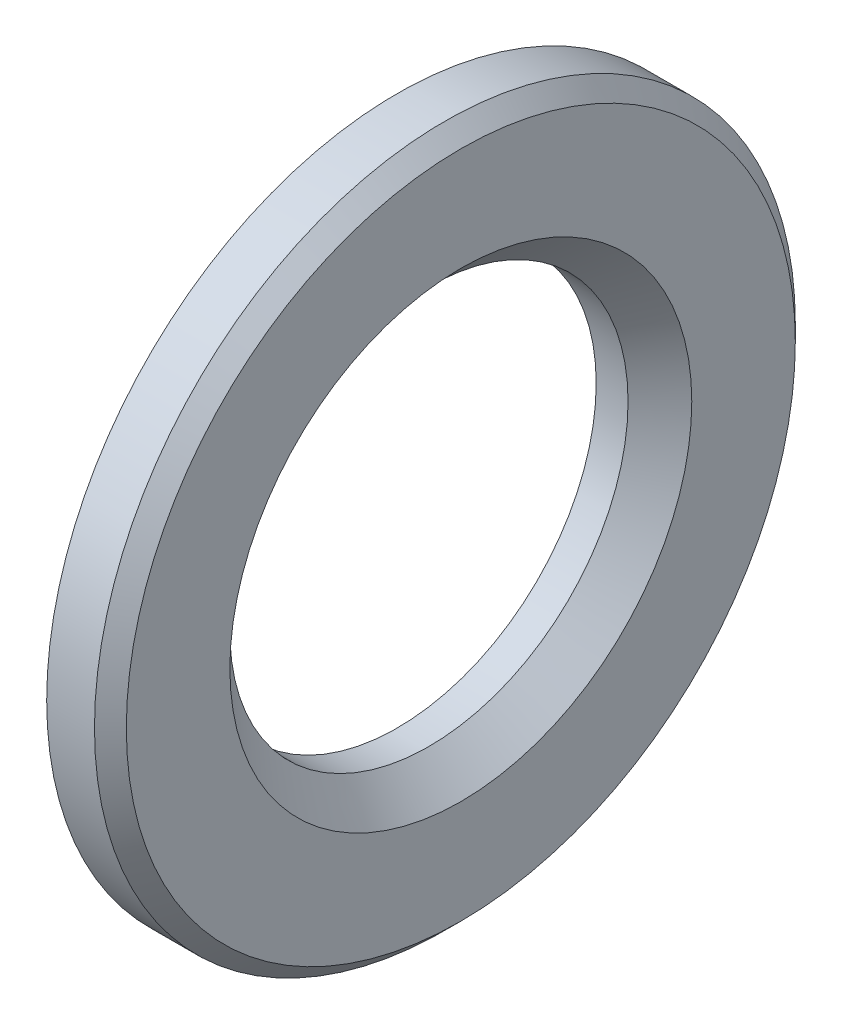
from build123d import *

# Parameters (mm, degrees)
SKETCH1_R          = 22
SKETCH1_R_2        = 12.5
BASE_EXTRUDE_DEPTH = 4
IDCHAMFER_SIZE     = 2
ODCHAMFER_SIZE     = 1


with BuildPart() as part:
    # Sketch1 → Base-Extrude (new body)
    with BuildSketch(Plane(origin=(0, 0, 0), x_dir=(0, 0, -1), z_dir=(1, 0, 0))):
        Circle(SKETCH1_R)
        Circle(SKETCH1_R_2, mode=Mode.SUBTRACT)
    extrude(amount=BASE_EXTRUDE_DEPTH)

    # IDchamfer
    idchamfer_edges = [part.edges().sort_by_distance(p)[0] for p in [
        (4, 0, 12.5),
    ]]
    chamfer(idchamfer_edges, length=IDCHAMFER_SIZE)

    # ODchamfer
    odchamfer_edges = [part.edges().sort_by_distance(p)[0] for p in [
        (4, 0, 22),
    ]]
    chamfer(odchamfer_edges, length=ODCHAMFER_SIZE)


solid = part.part
